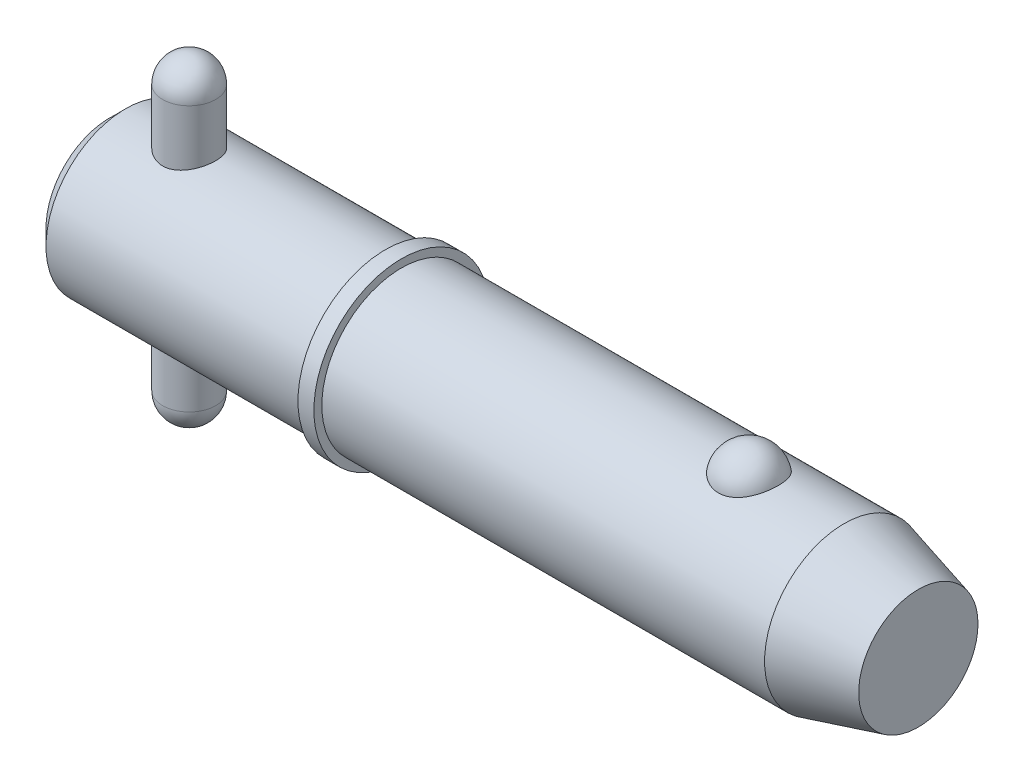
ISO-10303-21;
HEADER;
FILE_DESCRIPTION(('STEP AP214'),'2;1');
FILE_NAME('part.step','',(''),(''),'','','');
FILE_SCHEMA(('AUTOMOTIVE_DESIGN { 1 0 10303 214 1 1 1 1 }'));
ENDSEC;
DATA;
#1=APPLICATION_CONTEXT('core data for automotive mechanical design processes');
#2=APPLICATION_PROTOCOL_DEFINITION('international standard','automotive_design',2000,#1);
#3=PRODUCT_CONTEXT('',#1,'mechanical');
#4=PRODUCT('Part','Part','',(#3));
#5=PRODUCT_RELATED_PRODUCT_CATEGORY('part','',(#4));
#6=PRODUCT_DEFINITION_FORMATION('','',#4);
#7=PRODUCT_DEFINITION_CONTEXT('part definition',#1,'design');
#8=PRODUCT_DEFINITION('design','',#6,#7);
#9=PRODUCT_DEFINITION_SHAPE('','',#8);
#10=(LENGTH_UNIT() NAMED_UNIT(*) SI_UNIT(.MILLI.,.METRE.));
#11=(NAMED_UNIT(*) PLANE_ANGLE_UNIT() SI_UNIT($,.RADIAN.));
#12=(NAMED_UNIT(*) SI_UNIT($,.STERADIAN.) SOLID_ANGLE_UNIT());
#13=UNCERTAINTY_MEASURE_WITH_UNIT(LENGTH_MEASURE(1.E-05),#10,'distance_accuracy_value','');
#14=(GEOMETRIC_REPRESENTATION_CONTEXT(3) GLOBAL_UNCERTAINTY_ASSIGNED_CONTEXT((#13)) GLOBAL_UNIT_ASSIGNED_CONTEXT((#10,
#11,#12)) REPRESENTATION_CONTEXT('',''));
#15=CARTESIAN_POINT('',(0.,0.,0.));
#16=DIRECTION('',(0.,0.,1.));
#17=DIRECTION('',(1.,0.,0.));
#18=AXIS2_PLACEMENT_3D('',#15,#16,#17);
#19=CARTESIAN_POINT('',(9.525,19.05,0.));
#20=DIRECTION('',(0.,-1.,0.));
#21=DIRECTION('',(0.,0.,-1.));
#22=AXIS2_PLACEMENT_3D('',#19,#20,#21);
#23=CYLINDRICAL_SURFACE('',#22,3.175);
#24=CARTESIAN_POINT('',(9.525,-15.875,0.));
#25=DIRECTION('',(0.,-1.,0.));
#26=DIRECTION('',(0.,0.,-1.));
#27=AXIS2_PLACEMENT_3D('',#24,#25,#26);
#28=CIRCLE('',#27,3.175);
#29=CARTESIAN_POINT('',(9.525,-15.875,-3.175));
#30=VERTEX_POINT('',#29);
#31=EDGE_CURVE('P0_E10',#30,#30,#28,.F.);
#32=CARTESIAN_POINT('',(9.525,15.875,0.));
#33=DIRECTION('',(0.,-1.,0.));
#34=DIRECTION('',(0.,0.,-1.));
#35=AXIS2_PLACEMENT_3D('',#32,#33,#34);
#36=CIRCLE('',#35,3.175);
#37=CARTESIAN_POINT('',(9.525,15.875,-3.175));
#38=VERTEX_POINT('',#37);
#39=EDGE_CURVE('P0_E21',#38,#38,#36,.T.);
#40=CARTESIAN_POINT('',(9.525,-15.875,-3.175));
#41=CARTESIAN_POINT('',(9.525,-15.5442708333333,-3.175));
#42=CARTESIAN_POINT('',(9.525,-15.2135416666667,-3.175));
#43=CARTESIAN_POINT('',(9.525,-14.5520833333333,-3.175));
#44=CARTESIAN_POINT('',(9.525,-14.2213541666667,-3.175));
#45=CARTESIAN_POINT('',(9.525,-13.5598958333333,-3.175));
#46=CARTESIAN_POINT('',(9.525,-13.2291666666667,-3.175));
#47=CARTESIAN_POINT('',(9.525,-12.5677083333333,-3.175));
#48=CARTESIAN_POINT('',(9.525,-12.2369791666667,-3.175));
#49=CARTESIAN_POINT('',(9.525,-11.5755208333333,-3.175));
#50=CARTESIAN_POINT('',(9.525,-11.2447916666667,-3.175));
#51=CARTESIAN_POINT('',(9.525,-10.5833333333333,-3.175));
#52=CARTESIAN_POINT('',(9.525,-10.2526041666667,-3.175));
#53=CARTESIAN_POINT('',(9.525,-9.59114583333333,-3.175));
#54=CARTESIAN_POINT('',(9.525,-9.26041666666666,-3.175));
#55=CARTESIAN_POINT('',(9.525,-8.59895833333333,-3.175));
#56=CARTESIAN_POINT('',(9.525,-8.26822916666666,-3.175));
#57=CARTESIAN_POINT('',(9.525,-7.60677083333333,-3.175));
#58=CARTESIAN_POINT('',(9.525,-7.27604166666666,-3.175));
#59=CARTESIAN_POINT('',(9.525,-6.61458333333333,-3.175));
#60=CARTESIAN_POINT('',(9.525,-6.28385416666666,-3.175));
#61=CARTESIAN_POINT('',(9.525,-5.62239583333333,-3.175));
#62=CARTESIAN_POINT('',(9.525,-5.29166666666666,-3.175));
#63=CARTESIAN_POINT('',(9.525,-4.63020833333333,-3.175));
#64=CARTESIAN_POINT('',(9.525,-4.29947916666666,-3.175));
#65=CARTESIAN_POINT('',(9.525,-3.63802083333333,-3.175));
#66=CARTESIAN_POINT('',(9.525,-3.30729166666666,-3.175));
#67=CARTESIAN_POINT('',(9.525,-2.64583333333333,-3.175));
#68=CARTESIAN_POINT('',(9.525,-2.31510416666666,-3.175));
#69=CARTESIAN_POINT('',(9.525,-1.65364583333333,-3.175));
#70=CARTESIAN_POINT('',(9.525,-1.32291666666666,-3.175));
#71=CARTESIAN_POINT('',(9.525,-0.661458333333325,-3.175));
#72=CARTESIAN_POINT('',(9.525,-0.330729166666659,-3.175));
#73=CARTESIAN_POINT('',(9.525,0.330729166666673,-3.175));
#74=CARTESIAN_POINT('',(9.525,0.661458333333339,-3.175));
#75=CARTESIAN_POINT('',(9.525,1.32291666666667,-3.175));
#76=CARTESIAN_POINT('',(9.525,1.65364583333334,-3.175));
#77=CARTESIAN_POINT('',(9.525,2.31510416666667,-3.175));
#78=CARTESIAN_POINT('',(9.525,2.64583333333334,-3.175));
#79=CARTESIAN_POINT('',(9.525,3.30729166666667,-3.175));
#80=CARTESIAN_POINT('',(9.525,3.63802083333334,-3.175));
#81=CARTESIAN_POINT('',(9.525,4.29947916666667,-3.175));
#82=CARTESIAN_POINT('',(9.525,4.63020833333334,-3.175));
#83=CARTESIAN_POINT('',(9.525,5.29166666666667,-3.175));
#84=CARTESIAN_POINT('',(9.525,5.62239583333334,-3.175));
#85=CARTESIAN_POINT('',(9.525,6.28385416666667,-3.175));
#86=CARTESIAN_POINT('',(9.525,6.61458333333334,-3.175));
#87=CARTESIAN_POINT('',(9.525,7.27604166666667,-3.175));
#88=CARTESIAN_POINT('',(9.525,7.60677083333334,-3.175));
#89=CARTESIAN_POINT('',(9.525,8.26822916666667,-3.175));
#90=CARTESIAN_POINT('',(9.525,8.59895833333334,-3.175));
#91=CARTESIAN_POINT('',(9.525,9.26041666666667,-3.175));
#92=CARTESIAN_POINT('',(9.525,9.59114583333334,-3.175));
#93=CARTESIAN_POINT('',(9.525,10.2526041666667,-3.175));
#94=CARTESIAN_POINT('',(9.525,10.5833333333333,-3.175));
#95=CARTESIAN_POINT('',(9.525,11.2447916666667,-3.175));
#96=CARTESIAN_POINT('',(9.525,11.5755208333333,-3.175));
#97=CARTESIAN_POINT('',(9.525,12.2369791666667,-3.175));
#98=CARTESIAN_POINT('',(9.525,12.5677083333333,-3.175));
#99=CARTESIAN_POINT('',(9.525,13.2291666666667,-3.175));
#100=CARTESIAN_POINT('',(9.525,13.5598958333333,-3.175));
#101=CARTESIAN_POINT('',(9.525,14.2213541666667,-3.175));
#102=CARTESIAN_POINT('',(9.525,14.5520833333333,-3.175));
#103=CARTESIAN_POINT('',(9.525,15.2135416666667,-3.175));
#104=CARTESIAN_POINT('',(9.525,15.5442708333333,-3.175));
#105=CARTESIAN_POINT('',(9.525,15.875,-3.175));
#106=B_SPLINE_CURVE_WITH_KNOTS('',3,(#40,#41,#42,#43,#44,#45,#46,#47,#48,#49,#50,#51,#52,#53,
#54,#55,#56,#57,#58,#59,#60,#61,#62,#63,#64,#65,#66,#67,#68,#69,#70,#71,#72,#73,#74,#75,#76,#77,
#78,#79,#80,#81,#82,#83,#84,#85,#86,#87,#88,#89,#90,#91,#92,#93,#94,#95,#96,#97,#98,#99,#100,
#101,#102,#103,#104,#105),.UNSPECIFIED.,.F.,.F.,(4,2,2,2,2,2,2,2,2,2,2,2,2,2,2,2,2,2,2,2,2,2,2,
2,2,2,2,2,2,2,2,2,4),(0.,0.992187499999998,1.984375,2.9765625,3.96875,4.96093749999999,5.953125,
6.9453125,7.9375,8.92968749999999,9.921875,10.9140625,11.90625,12.8984375,13.890625,14.8828125,
15.875,16.8671875,17.859375,18.8515625,19.84375,20.8359375,21.828125,22.8203125,23.8125,
24.8046875,25.796875,26.7890625,27.78125,28.7734375,29.765625,30.7578125,31.75),.UNSPECIFIED.);
#107=EDGE_CURVE('P0_BSEAM14',#30,#38,#106,.T.);
#108=ORIENTED_EDGE('',*,*,#31,.T.);
#109=ORIENTED_EDGE('',*,*,#39,.T.);
#110=ORIENTED_EDGE('',*,*,#107,.T.);
#111=ORIENTED_EDGE('',*,*,#107,.F.);
#112=EDGE_LOOP('',(#108,#110,#109,#111));
#113=FACE_BOUND('',#112,.T.);
#114=ADVANCED_FACE('P0_F14',(#113),#23,.T.);
#115=CARTESIAN_POINT('',(9.525,-15.875,0.));
#116=DIRECTION('',(0.,0.,1.));
#117=DIRECTION('',(1.,0.,0.));
#118=AXIS2_PLACEMENT_3D('',#115,#116,#117);
#119=SPHERICAL_SURFACE('',#118,3.175);
#120=CARTESIAN_POINT('',(9.525,-15.875,0.));
#121=DIRECTION('',(0.,-1.,0.));
#122=DIRECTION('',(0.,0.,-1.));
#123=AXIS2_PLACEMENT_3D('',#120,#121,#122);
#124=SPHERICAL_SURFACE('',#123,3.175);
#125=ORIENTED_EDGE('',*,*,#31,.F.);
#126=EDGE_LOOP('',(#125));
#127=FACE_BOUND('',#126,.T.);
#128=ADVANCED_FACE('P0_F29',(#127),#124,.T.);
#129=CARTESIAN_POINT('',(9.525,15.875,0.));
#130=DIRECTION('',(0.,0.,1.));
#131=DIRECTION('',(1.,0.,0.));
#132=AXIS2_PLACEMENT_3D('',#129,#130,#131);
#133=SPHERICAL_SURFACE('',#132,3.175);
#134=CARTESIAN_POINT('',(9.525,15.875,0.));
#135=DIRECTION('',(0.,-1.,0.));
#136=DIRECTION('',(0.,0.,-1.));
#137=AXIS2_PLACEMENT_3D('',#134,#135,#136);
#138=SPHERICAL_SURFACE('',#137,3.175);
#139=ORIENTED_EDGE('',*,*,#39,.F.);
#140=EDGE_LOOP('',(#139));
#141=FACE_BOUND('',#140,.T.);
#142=ADVANCED_FACE('P0_F16',(#141),#138,.T.);
#143=CLOSED_SHELL('',(#114,#128,#142));
#144=MANIFOLD_SOLID_BREP('P0_B1',#143);
#145=CARTESIAN_POINT('',(0.,0.,0.));
#146=DIRECTION('',(1.,0.,0.));
#147=DIRECTION('',(0.,0.,-1.));
#148=AXIS2_PLACEMENT_3D('',#145,#146,#147);
#149=CYLINDRICAL_SURFACE('',#148,9.525);
#150=CARTESIAN_POINT('',(87.9430540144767,0.,0.));
#151=DIRECTION('',(1.,0.,0.));
#152=DIRECTION('',(0.,0.,-1.));
#153=AXIS2_PLACEMENT_3D('',#150,#151,#152);
#154=CIRCLE('',#153,9.525);
#155=CARTESIAN_POINT('',(87.9430540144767,0.,-9.525));
#156=VERTEX_POINT('',#155);
#157=EDGE_CURVE('P1_E81',#156,#156,#154,.T.);
#158=ORIENTED_EDGE('',*,*,#157,.F.);
#159=EDGE_LOOP('',(#158));
#160=FACE_BOUND('',#159,.T.);
#161=CARTESIAN_POINT('',(34.93,0.,0.));
#162=DIRECTION('',(1.,0.,0.));
#163=DIRECTION('',(0.,0.,-1.));
#164=AXIS2_PLACEMENT_3D('',#161,#162,#163);
#165=CIRCLE('',#164,9.525);
#166=CARTESIAN_POINT('',(34.93,0.,-9.525));
#167=VERTEX_POINT('',#166);
#168=EDGE_CURVE('P1_E85',#167,#167,#165,.T.);
#169=ORIENTED_EDGE('',*,*,#168,.T.);
#170=EDGE_LOOP('',(#169));
#171=FACE_BOUND('',#170,.T.);
#172=CARTESIAN_POINT('',(76.5457573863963,8.80405803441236,3.63513233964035));
#173=CARTESIAN_POINT('',(76.4516766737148,8.80405953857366,3.63513053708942));
#174=CARTESIAN_POINT('',(76.3575618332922,8.80561325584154,3.6313746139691));
#175=CARTESIAN_POINT('',(76.1700126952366,8.81177748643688,3.61638665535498));
#176=CARTESIAN_POINT('',(76.0765788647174,8.81638992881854,3.60514990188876));
#177=CARTESIAN_POINT('',(75.7979452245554,8.8346711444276,3.56024627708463));
#178=CARTESIAN_POINT('',(75.6146916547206,8.85278327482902,3.51538626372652));
#179=CARTESIAN_POINT('',(75.259509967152,8.89871214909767,3.39742145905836));
#180=CARTESIAN_POINT('',(75.0875533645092,8.92650327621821,3.32439116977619));
#181=CARTESIAN_POINT('',(74.758707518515,8.98874819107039,3.15220244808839));
#182=CARTESIAN_POINT('',(74.6018114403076,9.02319893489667,3.05305594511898));
#183=CARTESIAN_POINT('',(74.3022147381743,9.09629186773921,2.82797815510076));
#184=CARTESIAN_POINT('',(74.1600600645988,9.13502685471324,2.7013513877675));
#185=CARTESIAN_POINT('',(73.8982999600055,9.2118657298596,2.4264193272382));
#186=CARTESIAN_POINT('',(73.7787015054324,9.2499694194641,2.27810735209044));
#187=CARTESIAN_POINT('',(73.559645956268,9.3234108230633,1.95652290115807));
#188=CARTESIAN_POINT('',(73.4613174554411,9.35855090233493,1.78243511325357));
#189=CARTESIAN_POINT('',(73.2938190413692,9.42045142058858,1.41937246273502));
#190=CARTESIAN_POINT('',(73.2246511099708,9.44721128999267,1.23039658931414));
#191=CARTESIAN_POINT('',(73.1161994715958,9.48990641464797,0.840370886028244));
#192=CARTESIAN_POINT('',(73.0772880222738,9.50570658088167,0.639202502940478));
#193=CARTESIAN_POINT('',(73.0315550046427,9.52433146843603,0.232664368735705));
#194=CARTESIAN_POINT('',(73.0247324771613,9.52715657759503,0.0272947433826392));
#195=CARTESIAN_POINT('',(73.043255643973,9.51956918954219,-0.380478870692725));
#196=CARTESIAN_POINT('',(73.0684052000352,9.50923740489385,-0.582893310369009));
#197=CARTESIAN_POINT('',(73.1500253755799,9.47651897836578,-0.980293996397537));
#198=CARTESIAN_POINT('',(73.2064966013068,9.45413210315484,-1.17528009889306));
#199=CARTESIAN_POINT('',(73.3497192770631,9.39954044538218,-1.55263697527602));
#200=CARTESIAN_POINT('',(73.4365124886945,9.36732213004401,-1.73498993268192));
#201=CARTESIAN_POINT('',(73.6386103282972,9.29640700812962,-2.08177763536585));
#202=CARTESIAN_POINT('',(73.7539172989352,9.25770966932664,-2.24621090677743));
#203=CARTESIAN_POINT('',(74.011264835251,9.17775604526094,-2.5533833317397));
#204=CARTESIAN_POINT('',(74.1534344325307,9.136488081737,-2.696011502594));
#205=CARTESIAN_POINT('',(74.46089985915,9.05620497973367,-2.95451229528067));
#206=CARTESIAN_POINT('',(74.626193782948,9.01718965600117,-3.07038711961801));
#207=CARTESIAN_POINT('',(74.972052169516,8.9468001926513,-3.26976836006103));
#208=CARTESIAN_POINT('',(75.1522278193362,8.91528408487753,-3.35389750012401));
#209=CARTESIAN_POINT('',(75.5256514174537,8.86272514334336,-3.49043503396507));
#210=CARTESIAN_POINT('',(75.7188944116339,8.8416783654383,-3.54285537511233));
#211=CARTESIAN_POINT('',(76.1025036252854,8.81348056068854,-3.61241306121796));
#212=CARTESIAN_POINT('',(76.2925251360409,8.80568348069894,-3.63119339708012));
#213=CARTESIAN_POINT('',(76.6731906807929,8.80289410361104,-3.63795342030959));
#214=CARTESIAN_POINT('',(76.8638345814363,8.80789922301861,-3.62593932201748));
#215=CARTESIAN_POINT('',(77.234007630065,8.8297491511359,-3.57238430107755));
#216=CARTESIAN_POINT('',(77.4136976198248,8.84621463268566,-3.53178890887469));
#217=CARTESIAN_POINT('',(77.763422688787,8.88875330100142,-3.42331083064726));
#218=CARTESIAN_POINT('',(77.9334569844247,8.91482726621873,-3.35542593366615));
#219=CARTESIAN_POINT('',(78.2632377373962,8.97448239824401,-3.19248225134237));
#220=CARTESIAN_POINT('',(78.4226801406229,9.00821446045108,-3.09686474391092));
#221=CARTESIAN_POINT('',(78.7235136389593,9.07935398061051,-2.88162736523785));
#222=CARTESIAN_POINT('',(78.8649005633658,9.11676228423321,-2.76200196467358));
#223=CARTESIAN_POINT('',(79.1333193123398,9.19347419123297,-2.49516285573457));
#224=CARTESIAN_POINT('',(79.2592750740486,9.23277872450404,-2.34686614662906));
#225=CARTESIAN_POINT('',(79.4855227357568,9.30737610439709,-2.03093683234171));
#226=CARTESIAN_POINT('',(79.5858100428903,9.34266823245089,-1.86330077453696));
#227=CARTESIAN_POINT('',(79.7615149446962,9.40674710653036,-1.50744893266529));
#228=CARTESIAN_POINT('',(79.836041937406,9.4352917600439,-1.31874876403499));
#229=CARTESIAN_POINT('',(79.9541650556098,9.48144132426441,-0.930631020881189));
#230=CARTESIAN_POINT('',(79.9977608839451,9.49904612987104,-0.731213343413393));
#231=CARTESIAN_POINT('',(80.0531580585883,9.5215314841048,-0.327147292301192));
#232=CARTESIAN_POINT('',(80.0649354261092,9.52640243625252,-0.122495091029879));
#233=CARTESIAN_POINT('',(80.0563825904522,9.52289571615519,0.286018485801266));
#234=CARTESIAN_POINT('',(80.0360530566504,9.51451832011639,0.489879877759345));
#235=CARTESIAN_POINT('',(79.9638840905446,9.48544083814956,0.889994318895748));
#236=CARTESIAN_POINT('',(79.9121993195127,9.46480124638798,1.08627971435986));
#237=CARTESIAN_POINT('',(79.7784917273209,9.41333895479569,1.46682086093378));
#238=CARTESIAN_POINT('',(79.6964668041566,9.38251554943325,1.65107577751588));
#239=CARTESIAN_POINT('',(79.5031929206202,9.31365636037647,2.00346348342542));
#240=CARTESIAN_POINT('',(79.3917838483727,9.27558138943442,2.17150083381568));
#241=CARTESIAN_POINT('',(79.1422947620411,9.19638714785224,2.48563115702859));
#242=CARTESIAN_POINT('',(79.0042163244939,9.15526805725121,2.63172542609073));
#243=CARTESIAN_POINT('',(78.7048438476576,9.07465393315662,2.89750997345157));
#244=CARTESIAN_POINT('',(78.5436109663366,9.03515496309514,3.01726776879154));
#245=CARTESIAN_POINT('',(78.2016136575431,8.96227564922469,3.22732920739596));
#246=CARTESIAN_POINT('',(78.020841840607,8.92889763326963,3.31762165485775));
#247=CARTESIAN_POINT('',(77.6514451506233,8.8734538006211,3.46314419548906));
#248=CARTESIAN_POINT('',(77.4633237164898,8.85102983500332,3.51950082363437));
#249=CARTESIAN_POINT('',(77.1757869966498,8.8266696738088,3.57993683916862));
#250=CARTESIAN_POINT('',(77.0791339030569,8.82009725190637,3.59606217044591));
#251=CARTESIAN_POINT('',(76.8846770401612,8.81020897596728,3.62022512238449));
#252=CARTESIAN_POINT('',(76.7868741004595,8.80689090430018,3.62826825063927));
#253=CARTESIAN_POINT('',(76.6412243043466,8.80445615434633,3.63416760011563));
#254=CARTESIAN_POINT('',(76.5934952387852,8.80405727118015,3.63513325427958));
#255=CARTESIAN_POINT('',(76.5457573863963,8.80405803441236,3.63513233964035));
#256=B_SPLINE_CURVE_WITH_KNOTS('',3,(#172,#173,#174,#175,#176,#177,#178,#179,#180,#181,#182,
#183,#184,#185,#186,#187,#188,#189,#190,#191,#192,#193,#194,#195,#196,#197,#198,#199,#200,#201,
#202,#203,#204,#205,#206,#207,#208,#209,#210,#211,#212,#213,#214,#215,#216,#217,#218,#219,#220,
#221,#222,#223,#224,#225,#226,#227,#228,#229,#230,#231,#232,#233,#234,#235,#236,#237,#238,#239,
#240,#241,#242,#243,#244,#245,#246,#247,#248,#249,#250,#251,#252,#253,#254,#255),.UNSPECIFIED.,
.T.,.F.,(4,2,2,2,2,2,2,2,2,2,2,2,2,2,2,2,2,2,2,2,2,2,2,2,2,2,2,2,2,2,2,2,2,2,2,2,2,2,2,2,2,4),
(0.,0.282202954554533,0.564584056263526,1.13017050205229,1.69427128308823,2.258114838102,
2.83836627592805,3.41879688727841,4.02497117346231,4.63118665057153,5.24474754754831,
5.85829010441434,6.46808687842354,7.07789545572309,7.68854723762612,8.29924920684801,
8.91296283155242,9.52662591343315,10.1275338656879,10.7282152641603,11.2986646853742,
11.868998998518,12.4213015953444,12.973648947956,13.5380053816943,14.1024919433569,
14.695298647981,15.2882113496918,15.8999469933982,16.5116885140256,17.1238909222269,
17.7360805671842,18.3452748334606,18.9545113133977,19.567138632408,20.1797297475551,
20.7907316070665,21.4019653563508,21.9915938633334,22.2859053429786,22.5800161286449,
22.723209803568),.UNSPECIFIED.);
#257=CARTESIAN_POINT('',(76.5457573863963,8.80405803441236,3.63513233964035));
#258=VERTEX_POINT('',#257);
#259=EDGE_CURVE('P1_E35',#258,#258,#256,.T.);
#260=ORIENTED_EDGE('',*,*,#259,.T.);
#261=EDGE_LOOP('',(#260));
#262=FACE_BOUND('',#261,.T.);
#263=ADVANCED_FACE('P1_F13',(#160,#171,#262),#149,.T.);
#264=CARTESIAN_POINT('',(0.,0.,0.));
#265=DIRECTION('',(-1.,0.,0.));
#266=DIRECTION('',(0.,0.,1.));
#267=AXIS2_PLACEMENT_3D('',#264,#265,#266);
#268=PLANE('',#267);
#269=CARTESIAN_POINT('',(0.,0.,0.));
#270=DIRECTION('',(1.,0.,0.));
#271=DIRECTION('',(0.,0.,-1.));
#272=AXIS2_PLACEMENT_3D('',#269,#270,#271);
#273=CIRCLE('',#272,7.62);
#274=CARTESIAN_POINT('',(0.,0.,-7.62));
#275=VERTEX_POINT('',#274);
#276=EDGE_CURVE('P1_E9',#275,#275,#273,.T.);
#277=ORIENTED_EDGE('',*,*,#276,.F.);
#278=EDGE_LOOP('',(#277));
#279=FACE_BOUND('',#278,.T.);
#280=ADVANCED_FACE('P1_F15',(#279),#268,.T.);
#281=CARTESIAN_POINT('',(1.90499999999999,0.,0.));
#282=DIRECTION('',(1.,0.,0.));
#283=DIRECTION('',(0.,0.,-1.));
#284=AXIS2_PLACEMENT_3D('',#281,#282,#283);
#285=CONICAL_SURFACE('',#284,9.525,0.785398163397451);
#286=ORIENTED_EDGE('',*,*,#276,.T.);
#287=EDGE_LOOP('',(#286));
#288=FACE_BOUND('',#287,.T.);
#289=CARTESIAN_POINT('',(1.90499999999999,0.,0.));
#290=DIRECTION('',(1.,0.,0.));
#291=DIRECTION('',(0.,0.,-1.));
#292=AXIS2_PLACEMENT_3D('',#289,#290,#291);
#293=CIRCLE('',#292,9.525);
#294=CARTESIAN_POINT('',(1.90499999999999,0.,-9.525));
#295=VERTEX_POINT('',#294);
#296=EDGE_CURVE('P1_E26',#295,#295,#293,.T.);
#297=ORIENTED_EDGE('',*,*,#296,.F.);
#298=EDGE_LOOP('',(#297));
#299=FACE_BOUND('',#298,.T.);
#300=ADVANCED_FACE('P1_F77',(#288,#299),#285,.T.);
#301=CARTESIAN_POINT('',(0.,0.,0.));
#302=DIRECTION('',(1.,0.,0.));
#303=DIRECTION('',(0.,0.,-1.));
#304=AXIS2_PLACEMENT_3D('',#301,#302,#303);
#305=CYLINDRICAL_SURFACE('',#304,9.525);
#306=CARTESIAN_POINT('',(9.525,-8.98025612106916,3.175));
#307=CARTESIAN_POINT('',(9.35206354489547,-8.98025555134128,3.17500081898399));
#308=CARTESIAN_POINT('',(9.17913201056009,-8.98530617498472,3.16082293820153));
#309=CARTESIAN_POINT('',(8.83839221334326,-9.00485797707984,3.10467734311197));
#310=CARTESIAN_POINT('',(8.67058479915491,-9.0193607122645,3.06270505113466));
#311=CARTESIAN_POINT('',(8.34508461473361,-9.05599546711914,2.95260866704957));
#312=CARTESIAN_POINT('',(8.18737272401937,-9.07811252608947,2.88453582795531));
#313=CARTESIAN_POINT('',(7.88555684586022,-9.12746212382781,2.72434567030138));
#314=CARTESIAN_POINT('',(7.74145587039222,-9.1546957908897,2.63222304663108));
#315=CARTESIAN_POINT('',(7.46531411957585,-9.21240503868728,2.42268738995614));
#316=CARTESIAN_POINT('',(7.33388351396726,-9.24296141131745,2.30449228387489));
#317=CARTESIAN_POINT('',(7.09229340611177,-9.30319020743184,2.0478358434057));
#318=CARTESIAN_POINT('',(6.98213731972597,-9.33286248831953,1.90937126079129));
#319=CARTESIAN_POINT('',(6.78345450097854,-9.38891527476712,1.61164431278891));
#320=CARTESIAN_POINT('',(6.69556709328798,-9.41518969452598,1.45193356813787));
#321=CARTESIAN_POINT('',(6.54814671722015,-9.46053437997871,1.11896913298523));
#322=CARTESIAN_POINT('',(6.48860610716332,-9.47960658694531,0.945719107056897));
#323=CARTESIAN_POINT('',(6.40163866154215,-9.50782564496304,0.596991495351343));
#324=CARTESIAN_POINT('',(6.373166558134,-9.5172947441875,0.421801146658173));
#325=CARTESIAN_POINT('',(6.3458207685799,-9.52638456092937,0.068890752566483));
#326=CARTESIAN_POINT('',(6.34693945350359,-9.52600781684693,-0.108828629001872));
#327=CARTESIAN_POINT('',(6.37808050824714,-9.51566675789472,-0.454353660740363));
#328=CARTESIAN_POINT('',(6.4069675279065,-9.50607905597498,-0.622274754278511));
#329=CARTESIAN_POINT('',(6.490947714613,-9.47886621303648,-0.950732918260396));
#330=CARTESIAN_POINT('',(6.54604265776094,-9.46124052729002,-1.11126948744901));
#331=CARTESIAN_POINT('',(6.68153768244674,-9.41945253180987,-1.42288410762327));
#332=CARTESIAN_POINT('',(6.76226085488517,-9.3952073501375,-1.57381010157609));
#333=CARTESIAN_POINT('',(6.94645456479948,-9.34270397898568,-1.86030973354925));
#334=CARTESIAN_POINT('',(7.04993142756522,-9.31444467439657,-1.99587908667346));
#335=CARTESIAN_POINT('',(7.28241619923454,-9.25532159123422,-2.2545702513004));
#336=CARTESIAN_POINT('',(7.4123967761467,-9.22439783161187,-2.37680549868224));
#337=CARTESIAN_POINT('',(7.69127470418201,-9.1645528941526,-2.5980302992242));
#338=CARTESIAN_POINT('',(7.84017496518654,-9.13563202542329,-2.6970162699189));
#339=CARTESIAN_POINT('',(8.15547526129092,-9.08273917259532,-2.87016016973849));
#340=CARTESIAN_POINT('',(8.32209451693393,-9.05884361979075,-2.94394402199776));
#341=CARTESIAN_POINT('',(8.66638917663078,-9.01959241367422,-3.06210713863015));
#342=CARTESIAN_POINT('',(8.84405991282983,-9.00423318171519,-3.10649872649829));
#343=CARTESIAN_POINT('',(9.19682677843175,-8.98460345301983,-3.16281207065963));
#344=CARTESIAN_POINT('',(9.37167742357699,-8.9798639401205,-3.17610837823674));
#345=CARTESIAN_POINT('',(9.72113927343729,-8.9806993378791,-3.17374726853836));
#346=CARTESIAN_POINT('',(9.89575051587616,-8.98627237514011,-3.15809511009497));
#347=CARTESIAN_POINT('',(10.2335233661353,-9.00663737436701,-3.09951644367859));
#348=CARTESIAN_POINT('',(10.3968722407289,-9.02110608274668,-3.05754530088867));
#349=CARTESIAN_POINT('',(10.7141759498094,-9.05727657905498,-2.94866651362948));
#350=CARTESIAN_POINT('',(10.8681291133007,-9.07897964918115,-2.88175444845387));
#351=CARTESIAN_POINT('',(11.1676828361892,-9.12802586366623,-2.72248103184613));
#352=CARTESIAN_POINT('',(11.3128635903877,-9.1555260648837,-2.62937980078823));
#353=CARTESIAN_POINT('',(11.5860387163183,-9.21276315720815,-2.42120937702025));
#354=CARTESIAN_POINT('',(11.7140280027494,-9.24250070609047,-2.30613370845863));
#355=CARTESIAN_POINT('',(11.9555513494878,-9.30259247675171,-2.05070616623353));
#356=CARTESIAN_POINT('',(12.0680936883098,-9.33290753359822,-1.90940458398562));
#357=CARTESIAN_POINT('',(12.267933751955,-9.3893275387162,-1.60917665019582));
#358=CARTESIAN_POINT('',(12.3552323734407,-9.41543263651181,-1.45025092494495));
#359=CARTESIAN_POINT('',(12.5013088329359,-9.46036988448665,-1.12007606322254));
#360=CARTESIAN_POINT('',(12.5602723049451,-9.47924920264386,-0.9489158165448));
#361=CARTESIAN_POINT('',(12.6483355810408,-9.50781089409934,-0.598355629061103));
#362=CARTESIAN_POINT('',(12.6774461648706,-9.5174965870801,-0.4189586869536));
#363=CARTESIAN_POINT('',(12.7040070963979,-9.52632915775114,-0.066088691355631));
#364=CARTESIAN_POINT('',(12.7028811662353,-9.52594996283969,0.107266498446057));
#365=CARTESIAN_POINT('',(12.6725130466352,-9.51586223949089,0.451202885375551));
#366=CARTESIAN_POINT('',(12.643273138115,-9.50615446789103,0.621784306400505));
#367=CARTESIAN_POINT('',(12.5584514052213,-9.47867404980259,0.952633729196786));
#368=CARTESIAN_POINT('',(12.5032953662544,-9.46103195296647,1.1130225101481));
#369=CARTESIAN_POINT('',(12.3686013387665,-9.41949985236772,1.42233126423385));
#370=CARTESIAN_POINT('',(12.2890589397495,-9.39560871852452,1.57124915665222));
#371=CARTESIAN_POINT('',(12.1044667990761,-9.34294133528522,1.85938800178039));
#372=CARTESIAN_POINT('',(11.9985831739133,-9.31401720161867,1.9980473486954));
#373=CARTESIAN_POINT('',(11.7657327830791,-9.25490239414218,2.25609475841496));
#374=CARTESIAN_POINT('',(11.6387592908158,-9.22471131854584,2.37547664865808));
#375=CARTESIAN_POINT('',(11.3613902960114,-9.16505913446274,2.59633024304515));
#376=CARTESIAN_POINT('',(11.2102725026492,-9.13567286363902,2.69691791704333));
#377=CARTESIAN_POINT('',(10.8923631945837,-9.08241113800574,2.87119803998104));
#378=CARTESIAN_POINT('',(10.7255757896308,-9.05853424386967,2.94489751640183));
#379=CARTESIAN_POINT('',(10.3887212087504,-9.02021736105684,3.06020415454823));
#380=CARTESIAN_POINT('',(10.219143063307,-9.00539959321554,3.10311136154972));
#381=CARTESIAN_POINT('',(9.87470703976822,-8.98542092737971,3.16050396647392));
#382=CARTESIAN_POINT('',(9.699851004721,-8.98025669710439,3.17499917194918));
#383=CARTESIAN_POINT('',(9.525,-8.98025612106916,3.175));
#384=B_SPLINE_CURVE_WITH_KNOTS('',3,(#306,#307,#308,#309,#310,#311,#312,#313,#314,#315,#316,
#317,#318,#319,#320,#321,#322,#323,#324,#325,#326,#327,#328,#329,#330,#331,#332,#333,#334,#335,
#336,#337,#338,#339,#340,#341,#342,#343,#344,#345,#346,#347,#348,#349,#350,#351,#352,#353,#354,
#355,#356,#357,#358,#359,#360,#361,#362,#363,#364,#365,#366,#367,#368,#369,#370,#371,#372,#373,
#374,#375,#376,#377,#378,#379,#380,#381,#382,#383),.UNSPECIFIED.,.T.,.F.,(4,2,2,2,2,2,2,2,2,2,2,
2,2,2,2,2,2,2,2,2,2,2,2,2,2,2,2,2,2,2,2,2,2,2,2,2,2,2,4),(0.,0.518161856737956,1.03640907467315,
1.55364379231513,2.07099270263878,2.60671746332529,3.14252816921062,3.69231882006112,
4.24196117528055,4.77247962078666,5.30286129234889,5.81244090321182,6.32205505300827,
6.83836754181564,7.3548237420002,7.89559553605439,8.43645060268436,8.98501631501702,
9.53335188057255,10.056948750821,10.5804505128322,11.0859695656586,11.5915782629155,
12.1132237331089,12.6350231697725,13.1819271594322,13.7288117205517,14.2720628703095,
14.815117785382,15.3326491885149,15.8501386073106,16.3594083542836,16.868770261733,
17.3969527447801,17.925304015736,18.4743376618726,19.023227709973,19.5473069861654,
20.0712053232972),.UNSPECIFIED.);
#385=CARTESIAN_POINT('',(9.525,-8.98025612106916,3.175));
#386=VERTEX_POINT('',#385);
#387=EDGE_CURVE('P1_E17',#386,#386,#384,.T.);
#388=ORIENTED_EDGE('',*,*,#387,.F.);
#389=EDGE_LOOP('',(#388));
#390=FACE_BOUND('',#389,.T.);
#391=CARTESIAN_POINT('',(9.525,8.98025612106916,3.175));
#392=CARTESIAN_POINT('',(9.69793645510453,8.98025555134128,3.17500081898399));
#393=CARTESIAN_POINT('',(9.87086798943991,8.98530617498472,3.16082293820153));
#394=CARTESIAN_POINT('',(10.2116077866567,9.00485797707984,3.10467734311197));
#395=CARTESIAN_POINT('',(10.3794152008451,9.0193607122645,3.06270505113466));
#396=CARTESIAN_POINT('',(10.7049153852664,9.05599546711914,2.95260866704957));
#397=CARTESIAN_POINT('',(10.8626272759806,9.07811252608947,2.88453582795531));
#398=CARTESIAN_POINT('',(11.1644431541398,9.12746212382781,2.72434567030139));
#399=CARTESIAN_POINT('',(11.3085441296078,9.15469579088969,2.63222304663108));
#400=CARTESIAN_POINT('',(11.5846858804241,9.21240503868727,2.42268738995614));
#401=CARTESIAN_POINT('',(11.7161164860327,9.24296141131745,2.30449228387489));
#402=CARTESIAN_POINT('',(11.9577065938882,9.30319020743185,2.0478358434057));
#403=CARTESIAN_POINT('',(12.067862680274,9.33286248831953,1.90937126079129));
#404=CARTESIAN_POINT('',(12.2665454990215,9.38891527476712,1.61164431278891));
#405=CARTESIAN_POINT('',(12.354432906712,9.41518969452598,1.45193356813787));
#406=CARTESIAN_POINT('',(12.5018532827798,9.46053437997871,1.11896913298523));
#407=CARTESIAN_POINT('',(12.5613938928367,9.47960658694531,0.945719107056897));
#408=CARTESIAN_POINT('',(12.6483613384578,9.50782564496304,0.596991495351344));
#409=CARTESIAN_POINT('',(12.676833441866,9.5172947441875,0.421801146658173));
#410=CARTESIAN_POINT('',(12.7041792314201,9.52638456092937,0.0688907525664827));
#411=CARTESIAN_POINT('',(12.7030605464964,9.52600781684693,-0.108828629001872));
#412=CARTESIAN_POINT('',(12.6719194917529,9.51566675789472,-0.454353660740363));
#413=CARTESIAN_POINT('',(12.6430324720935,9.50607905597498,-0.622274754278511));
#414=CARTESIAN_POINT('',(12.559052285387,9.47886621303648,-0.950732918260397));
#415=CARTESIAN_POINT('',(12.5039573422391,9.46124052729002,-1.11126948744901));
#416=CARTESIAN_POINT('',(12.3684623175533,9.41945253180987,-1.42288410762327));
#417=CARTESIAN_POINT('',(12.2877391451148,9.3952073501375,-1.57381010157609));
#418=CARTESIAN_POINT('',(12.1035454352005,9.34270397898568,-1.86030973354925));
#419=CARTESIAN_POINT('',(12.0000685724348,9.31444467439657,-1.99587908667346));
#420=CARTESIAN_POINT('',(11.7675838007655,9.25532159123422,-2.2545702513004));
#421=CARTESIAN_POINT('',(11.6376032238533,9.22439783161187,-2.37680549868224));
#422=CARTESIAN_POINT('',(11.358725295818,9.1645528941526,-2.5980302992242));
#423=CARTESIAN_POINT('',(11.2098250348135,9.13563202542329,-2.6970162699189));
#424=CARTESIAN_POINT('',(10.8945247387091,9.08273917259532,-2.87016016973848));
#425=CARTESIAN_POINT('',(10.7279054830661,9.05884361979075,-2.94394402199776));
#426=CARTESIAN_POINT('',(10.3836108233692,9.01959241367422,-3.06210713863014));
#427=CARTESIAN_POINT('',(10.2059400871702,9.00423318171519,-3.10649872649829));
#428=CARTESIAN_POINT('',(9.85317322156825,8.98460345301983,-3.16281207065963));
#429=CARTESIAN_POINT('',(9.67832257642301,8.9798639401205,-3.17610837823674));
#430=CARTESIAN_POINT('',(9.32886072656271,8.9806993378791,-3.17374726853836));
#431=CARTESIAN_POINT('',(9.15424948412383,8.98627237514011,-3.15809511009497));
#432=CARTESIAN_POINT('',(8.81647663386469,9.00663737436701,-3.09951644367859));
#433=CARTESIAN_POINT('',(8.65312775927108,9.02110608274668,-3.05754530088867));
#434=CARTESIAN_POINT('',(8.33582405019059,9.05727657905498,-2.94866651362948));
#435=CARTESIAN_POINT('',(8.18187088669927,9.07897964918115,-2.88175444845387));
#436=CARTESIAN_POINT('',(7.88231716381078,9.12802586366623,-2.72248103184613));
#437=CARTESIAN_POINT('',(7.73713640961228,9.1555260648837,-2.62937980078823));
#438=CARTESIAN_POINT('',(7.46396128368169,9.21276315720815,-2.42120937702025));
#439=CARTESIAN_POINT('',(7.33597199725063,9.24250070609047,-2.30613370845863));
#440=CARTESIAN_POINT('',(7.09444865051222,9.30259247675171,-2.05070616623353));
#441=CARTESIAN_POINT('',(6.98190631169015,9.33290753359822,-1.90940458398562));
#442=CARTESIAN_POINT('',(6.78206624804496,9.3893275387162,-1.60917665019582));
#443=CARTESIAN_POINT('',(6.6947676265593,9.41543263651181,-1.45025092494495));
#444=CARTESIAN_POINT('',(6.54869116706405,9.46036988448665,-1.12007606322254));
#445=CARTESIAN_POINT('',(6.48972769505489,9.47924920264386,-0.948915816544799));
#446=CARTESIAN_POINT('',(6.40166441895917,9.50781089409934,-0.598355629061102));
#447=CARTESIAN_POINT('',(6.3725538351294,9.5174965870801,-0.418958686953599));
#448=CARTESIAN_POINT('',(6.34599290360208,9.52632915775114,-0.0660886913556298));
#449=CARTESIAN_POINT('',(6.3471188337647,9.52594996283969,0.107266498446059));
#450=CARTESIAN_POINT('',(6.37748695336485,9.51586223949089,0.451202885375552));
#451=CARTESIAN_POINT('',(6.40672686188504,9.50615446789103,0.621784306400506));
#452=CARTESIAN_POINT('',(6.49154859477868,9.47867404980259,0.952633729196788));
#453=CARTESIAN_POINT('',(6.54670463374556,9.46103195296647,1.11302251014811));
#454=CARTESIAN_POINT('',(6.68139866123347,9.41949985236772,1.42233126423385));
#455=CARTESIAN_POINT('',(6.76094106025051,9.39560871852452,1.57124915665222));
#456=CARTESIAN_POINT('',(6.94553320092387,9.34294133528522,1.85938800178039));
#457=CARTESIAN_POINT('',(7.05141682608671,9.31401720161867,1.9980473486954));
#458=CARTESIAN_POINT('',(7.28426721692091,9.25490239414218,2.25609475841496));
#459=CARTESIAN_POINT('',(7.41124070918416,9.22471131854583,2.37547664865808));
#460=CARTESIAN_POINT('',(7.68860970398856,9.16505913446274,2.59633024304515));
#461=CARTESIAN_POINT('',(7.83972749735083,9.13567286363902,2.69691791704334));
#462=CARTESIAN_POINT('',(8.15763680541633,9.08241113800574,2.87119803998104));
#463=CARTESIAN_POINT('',(8.32442421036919,9.05853424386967,2.94489751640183));
#464=CARTESIAN_POINT('',(8.66127879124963,9.02021736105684,3.06020415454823));
#465=CARTESIAN_POINT('',(8.83085693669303,9.00539959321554,3.10311136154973));
#466=CARTESIAN_POINT('',(9.17529296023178,8.98542092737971,3.16050396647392));
#467=CARTESIAN_POINT('',(9.350148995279,8.98025669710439,3.17499917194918));
#468=CARTESIAN_POINT('',(9.525,8.98025612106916,3.175));
#469=B_SPLINE_CURVE_WITH_KNOTS('',3,(#391,#392,#393,#394,#395,#396,#397,#398,#399,#400,#401,
#402,#403,#404,#405,#406,#407,#408,#409,#410,#411,#412,#413,#414,#415,#416,#417,#418,#419,#420,
#421,#422,#423,#424,#425,#426,#427,#428,#429,#430,#431,#432,#433,#434,#435,#436,#437,#438,#439,
#440,#441,#442,#443,#444,#445,#446,#447,#448,#449,#450,#451,#452,#453,#454,#455,#456,#457,#458,
#459,#460,#461,#462,#463,#464,#465,#466,#467,#468),.UNSPECIFIED.,.T.,.F.,(4,2,2,2,2,2,2,2,2,2,2,
2,2,2,2,2,2,2,2,2,2,2,2,2,2,2,2,2,2,2,2,2,2,2,2,2,2,2,4),(0.,0.518161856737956,1.03640907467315,
1.55364379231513,2.07099270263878,2.60671746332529,3.14252816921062,3.69231882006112,
4.24196117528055,4.77247962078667,5.30286129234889,5.81244090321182,6.32205505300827,
6.83836754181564,7.3548237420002,7.89559553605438,8.43645060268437,8.98501631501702,
9.53335188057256,10.056948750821,10.5804505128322,11.0859695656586,11.5915782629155,
12.1132237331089,12.6350231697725,13.1819271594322,13.7288117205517,14.2720628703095,
14.815117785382,15.3326491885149,15.8501386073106,16.3594083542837,16.868770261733,
17.3969527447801,17.9253040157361,18.4743376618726,19.023227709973,19.5473069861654,
20.0712053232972),.UNSPECIFIED.);
#470=CARTESIAN_POINT('',(9.525,8.98025612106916,3.175));
#471=VERTEX_POINT('',#470);
#472=EDGE_CURVE('P1_E43',#471,#471,#469,.T.);
#473=ORIENTED_EDGE('',*,*,#472,.F.);
#474=EDGE_LOOP('',(#473));
#475=FACE_BOUND('',#474,.T.);
#476=ORIENTED_EDGE('',*,*,#296,.T.);
#477=EDGE_LOOP('',(#476));
#478=FACE_BOUND('',#477,.T.);
#479=CARTESIAN_POINT('',(33.025,0.,0.));
#480=DIRECTION('',(1.,0.,0.));
#481=DIRECTION('',(0.,0.,-1.));
#482=AXIS2_PLACEMENT_3D('',#479,#480,#481);
#483=CIRCLE('',#482,9.525);
#484=CARTESIAN_POINT('',(33.025,0.,-9.525));
#485=VERTEX_POINT('',#484);
#486=EDGE_CURVE('P1_E31',#485,#485,#483,.T.);
#487=ORIENTED_EDGE('',*,*,#486,.F.);
#488=EDGE_LOOP('',(#487));
#489=FACE_BOUND('',#488,.T.);
#490=ADVANCED_FACE('P1_F103',(#390,#475,#478,#489),#305,.T.);
#491=CARTESIAN_POINT('',(33.025,9.525,0.));
#492=DIRECTION('',(-1.,0.,0.));
#493=DIRECTION('',(0.,0.,1.));
#494=AXIS2_PLACEMENT_3D('',#491,#492,#493);
#495=PLANE('',#494);
#496=ORIENTED_EDGE('',*,*,#486,.T.);
#497=EDGE_LOOP('',(#496));
#498=FACE_BOUND('',#497,.T.);
#499=CARTESIAN_POINT('',(33.025,0.,0.));
#500=DIRECTION('',(1.,0.,0.));
#501=DIRECTION('',(0.,0.,-1.));
#502=AXIS2_PLACEMENT_3D('',#499,#500,#501);
#503=CIRCLE('',#502,10.4775);
#504=CARTESIAN_POINT('',(33.025,0.,-10.4775));
#505=VERTEX_POINT('',#504);
#506=EDGE_CURVE('P1_E91',#505,#505,#503,.T.);
#507=ORIENTED_EDGE('',*,*,#506,.F.);
#508=EDGE_LOOP('',(#507));
#509=FACE_BOUND('',#508,.T.);
#510=ADVANCED_FACE('P1_F100',(#498,#509),#495,.T.);
#511=CARTESIAN_POINT('',(0.,0.,0.));
#512=DIRECTION('',(1.,0.,0.));
#513=DIRECTION('',(0.,0.,-1.));
#514=AXIS2_PLACEMENT_3D('',#511,#512,#513);
#515=CYLINDRICAL_SURFACE('',#514,10.4775);
#516=ORIENTED_EDGE('',*,*,#506,.T.);
#517=EDGE_LOOP('',(#516));
#518=FACE_BOUND('',#517,.T.);
#519=CARTESIAN_POINT('',(34.93,0.,0.));
#520=DIRECTION('',(1.,0.,0.));
#521=DIRECTION('',(0.,0.,-1.));
#522=AXIS2_PLACEMENT_3D('',#519,#520,#521);
#523=CIRCLE('',#522,10.4775);
#524=CARTESIAN_POINT('',(34.93,0.,-10.4775));
#525=VERTEX_POINT('',#524);
#526=EDGE_CURVE('P1_E88',#525,#525,#523,.T.);
#527=ORIENTED_EDGE('',*,*,#526,.F.);
#528=EDGE_LOOP('',(#527));
#529=FACE_BOUND('',#528,.T.);
#530=ADVANCED_FACE('P1_F68',(#518,#529),#515,.T.);
#531=CARTESIAN_POINT('',(34.93,10.4775,0.));
#532=DIRECTION('',(1.,0.,0.));
#533=DIRECTION('',(0.,0.,-1.));
#534=AXIS2_PLACEMENT_3D('',#531,#532,#533);
#535=PLANE('',#534);
#536=ORIENTED_EDGE('',*,*,#526,.T.);
#537=EDGE_LOOP('',(#536));
#538=FACE_BOUND('',#537,.T.);
#539=ORIENTED_EDGE('',*,*,#168,.F.);
#540=EDGE_LOOP('',(#539));
#541=FACE_BOUND('',#540,.T.);
#542=ADVANCED_FACE('P1_F62',(#538,#541),#535,.T.);
#543=CARTESIAN_POINT('',(96.83,0.,0.));
#544=DIRECTION('',(-1.,0.,0.));
#545=DIRECTION('',(0.,0.,1.));
#546=AXIS2_PLACEMENT_3D('',#543,#544,#545);
#547=CONICAL_SURFACE('',#546,7.14375000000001,0.26179938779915);
#548=ORIENTED_EDGE('',*,*,#157,.T.);
#549=EDGE_LOOP('',(#548));
#550=FACE_BOUND('',#549,.T.);
#551=CARTESIAN_POINT('',(96.83,0.,0.));
#552=DIRECTION('',(1.,0.,0.));
#553=DIRECTION('',(0.,0.,-1.));
#554=AXIS2_PLACEMENT_3D('',#551,#552,#553);
#555=CIRCLE('',#554,7.14375000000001);
#556=CARTESIAN_POINT('',(96.83,0.,-7.14375000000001));
#557=VERTEX_POINT('',#556);
#558=EDGE_CURVE('P1_E42',#557,#557,#555,.T.);
#559=ORIENTED_EDGE('',*,*,#558,.F.);
#560=EDGE_LOOP('',(#559));
#561=FACE_BOUND('',#560,.T.);
#562=ADVANCED_FACE('P1_F59',(#550,#561),#547,.T.);
#563=CARTESIAN_POINT('',(96.83,7.14375000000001,0.));
#564=DIRECTION('',(1.,0.,0.));
#565=DIRECTION('',(0.,0.,-1.));
#566=AXIS2_PLACEMENT_3D('',#563,#564,#565);
#567=PLANE('',#566);
#568=ORIENTED_EDGE('',*,*,#558,.T.);
#569=EDGE_LOOP('',(#568));
#570=FACE_BOUND('',#569,.T.);
#571=ADVANCED_FACE('P1_F55',(#570),#567,.T.);
#572=CARTESIAN_POINT('',(76.5457573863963,8.57249999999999,0.));
#573=DIRECTION('',(-1.,0.,0.));
#574=DIRECTION('',(0.,1.,0.));
#575=AXIS2_PLACEMENT_3D('',#572,#573,#574);
#576=SPHERICAL_SURFACE('',#575,3.64250000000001);
#577=ORIENTED_EDGE('',*,*,#259,.F.);
#578=EDGE_LOOP('',(#577));
#579=FACE_BOUND('',#578,.T.);
#580=ADVANCED_FACE('P1_F50',(#579),#576,.T.);
#581=CARTESIAN_POINT('',(9.525,-10.4775,0.));
#582=DIRECTION('',(0.,1.,0.));
#583=DIRECTION('',(0.,0.,1.));
#584=AXIS2_PLACEMENT_3D('',#581,#582,#583);
#585=CYLINDRICAL_SURFACE('',#584,3.175);
#586=ORIENTED_EDGE('',*,*,#387,.T.);
#587=EDGE_LOOP('',(#586));
#588=FACE_BOUND('',#587,.T.);
#589=ORIENTED_EDGE('',*,*,#472,.T.);
#590=EDGE_LOOP('',(#589));
#591=FACE_BOUND('',#590,.T.);
#592=ADVANCED_FACE('P1_F54',(#588,#591),#585,.F.);
#593=CLOSED_SHELL('',(#263,#280,#300,#490,#510,#530,#542,#562,#571,#580,#592));
#594=MANIFOLD_SOLID_BREP('P1_B1',#593);
#595=ADVANCED_BREP_SHAPE_REPRESENTATION('',(#18,#144,#594),#14);
#596=SHAPE_DEFINITION_REPRESENTATION(#9,#595);
ENDSEC;
END-ISO-10303-21;
